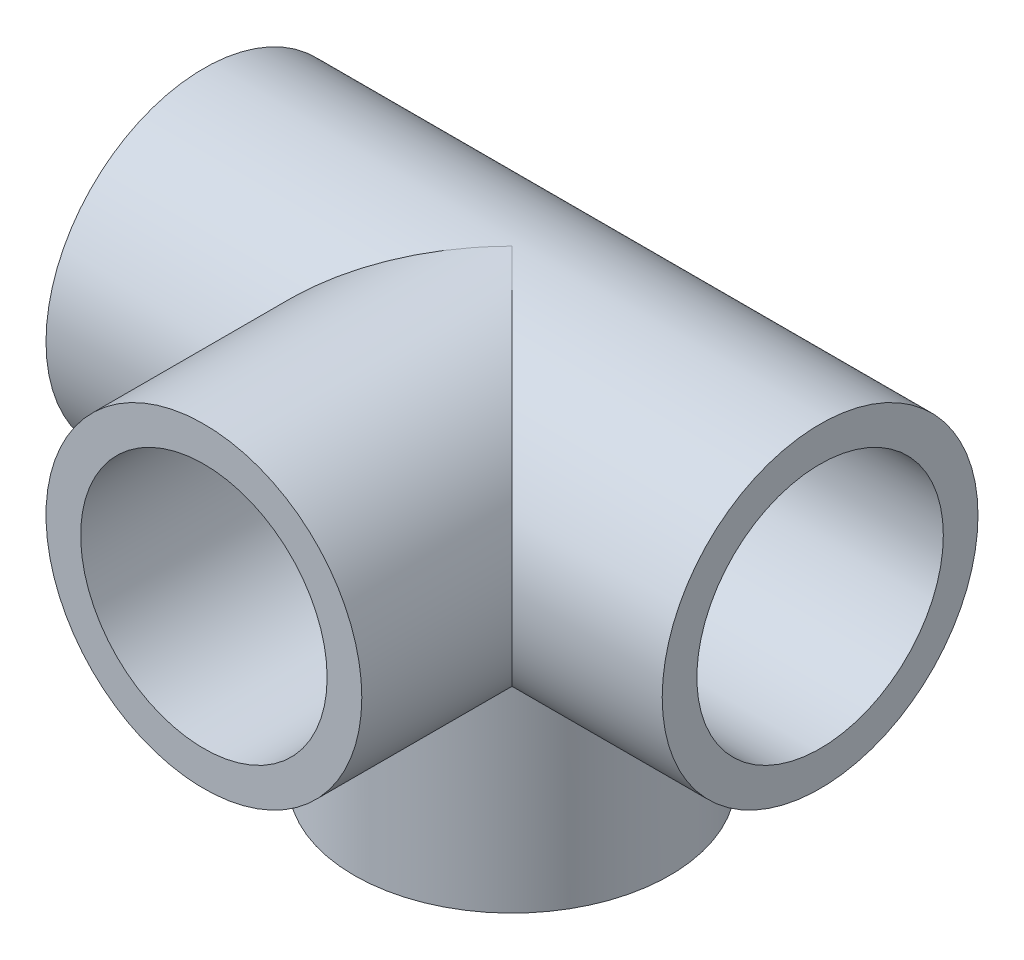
ISO-10303-21;
HEADER;
FILE_DESCRIPTION(('STEP AP214'),'2;1');
FILE_NAME('part.step','',(''),(''),'','','');
FILE_SCHEMA(('AUTOMOTIVE_DESIGN { 1 0 10303 214 1 1 1 1 }'));
ENDSEC;
DATA;
#1=APPLICATION_CONTEXT('core data for automotive mechanical design processes');
#2=APPLICATION_PROTOCOL_DEFINITION('international standard','automotive_design',2000,#1);
#3=PRODUCT_CONTEXT('',#1,'mechanical');
#4=PRODUCT('Part','Part','',(#3));
#5=PRODUCT_RELATED_PRODUCT_CATEGORY('part','',(#4));
#6=PRODUCT_DEFINITION_FORMATION('','',#4);
#7=PRODUCT_DEFINITION_CONTEXT('part definition',#1,'design');
#8=PRODUCT_DEFINITION('design','',#6,#7);
#9=PRODUCT_DEFINITION_SHAPE('','',#8);
#10=(LENGTH_UNIT() NAMED_UNIT(*) SI_UNIT(.MILLI.,.METRE.));
#11=(NAMED_UNIT(*) PLANE_ANGLE_UNIT() SI_UNIT($,.RADIAN.));
#12=(NAMED_UNIT(*) SI_UNIT($,.STERADIAN.) SOLID_ANGLE_UNIT());
#13=UNCERTAINTY_MEASURE_WITH_UNIT(LENGTH_MEASURE(1.E-05),#10,'distance_accuracy_value','');
#14=(GEOMETRIC_REPRESENTATION_CONTEXT(3) GLOBAL_UNCERTAINTY_ASSIGNED_CONTEXT((#13)) GLOBAL_UNIT_ASSIGNED_CONTEXT((#10,
#11,#12)) REPRESENTATION_CONTEXT('',''));
#15=CARTESIAN_POINT('',(0.,0.,0.));
#16=DIRECTION('',(0.,0.,1.));
#17=DIRECTION('',(1.,0.,0.));
#18=AXIS2_PLACEMENT_3D('',#15,#16,#17);
#19=CARTESIAN_POINT('',(40.,0.,0.));
#20=DIRECTION('',(-1.,0.,0.));
#21=DIRECTION('',(0.,0.,1.));
#22=AXIS2_PLACEMENT_3D('',#19,#20,#21);
#23=CYLINDRICAL_SURFACE('',#22,20.5);
#24=CARTESIAN_POINT('',(-40.,0.,0.));
#25=DIRECTION('',(1.,0.,0.));
#26=DIRECTION('',(0.,0.,-1.));
#27=AXIS2_PLACEMENT_3D('',#24,#25,#26);
#28=CIRCLE('',#27,20.5);
#29=CARTESIAN_POINT('',(-40.,0.,-20.5));
#30=VERTEX_POINT('',#29);
#31=EDGE_CURVE('E110',#30,#30,#28,.T.);
#32=ORIENTED_EDGE('',*,*,#31,.T.);
#33=EDGE_LOOP('',(#32));
#34=FACE_BOUND('',#33,.T.);
#35=CARTESIAN_POINT('',(40.,0.,0.));
#36=DIRECTION('',(1.,0.,0.));
#37=DIRECTION('',(0.,0.,-1.));
#38=AXIS2_PLACEMENT_3D('',#35,#36,#37);
#39=CIRCLE('',#38,20.5);
#40=CARTESIAN_POINT('',(40.,0.,-20.5));
#41=VERTEX_POINT('',#40);
#42=EDGE_CURVE('E107',#41,#41,#39,.T.);
#43=ORIENTED_EDGE('',*,*,#42,.F.);
#44=EDGE_LOOP('',(#43));
#45=FACE_BOUND('',#44,.T.);
#46=CARTESIAN_POINT('',(0.,0.,0.));
#47=DIRECTION('',(-0.707106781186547,0.,-0.707106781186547));
#48=DIRECTION('',(-0.707106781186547,0.,0.707106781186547));
#49=AXIS2_PLACEMENT_3D('',#46,#47,#48);
#50=ELLIPSE('',#49,28.9913780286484,20.5);
#51=CARTESIAN_POINT('',(0.,20.5,0.));
#52=VERTEX_POINT('',#51);
#53=CARTESIAN_POINT('',(-14.4956890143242,-14.4956890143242,14.4956890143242));
#54=VERTEX_POINT('',#53);
#55=EDGE_CURVE('E51',#52,#54,#50,.F.);
#56=ORIENTED_EDGE('',*,*,#55,.F.);
#57=CARTESIAN_POINT('',(0.,0.,0.));
#58=DIRECTION('',(-0.707106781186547,0.,0.707106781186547));
#59=DIRECTION('',(-0.707106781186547,0.,-0.707106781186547));
#60=AXIS2_PLACEMENT_3D('',#57,#58,#59);
#61=ELLIPSE('',#60,28.9913780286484,20.5);
#62=CARTESIAN_POINT('',(14.4956890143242,-14.4956890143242,14.4956890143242));
#63=VERTEX_POINT('',#62);
#64=EDGE_CURVE('E59',#63,#52,#61,.T.);
#65=ORIENTED_EDGE('',*,*,#64,.F.);
#66=CARTESIAN_POINT('',(0.,0.,0.));
#67=DIRECTION('',(-0.707106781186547,-0.707106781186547,0.));
#68=DIRECTION('',(-0.707106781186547,0.707106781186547,0.));
#69=AXIS2_PLACEMENT_3D('',#66,#67,#68);
#70=ELLIPSE('',#69,28.9913780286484,20.5);
#71=CARTESIAN_POINT('',(0.,0.,-20.5));
#72=VERTEX_POINT('',#71);
#73=EDGE_CURVE('E105',#63,#72,#70,.F.);
#74=ORIENTED_EDGE('',*,*,#73,.T.);
#75=CARTESIAN_POINT('',(0.,0.,0.));
#76=DIRECTION('',(-0.707106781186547,0.707106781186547,0.));
#77=DIRECTION('',(-0.707106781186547,-0.707106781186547,0.));
#78=AXIS2_PLACEMENT_3D('',#75,#76,#77);
#79=ELLIPSE('',#78,28.9913780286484,20.5);
#80=EDGE_CURVE('E42',#72,#54,#79,.T.);
#81=ORIENTED_EDGE('',*,*,#80,.T.);
#82=EDGE_LOOP('',(#56,#65,#74,#81));
#83=FACE_BOUND('',#82,.T.);
#84=ADVANCED_FACE('F32',(#34,#45,#83),#23,.T.);
#85=CARTESIAN_POINT('',(0.,-40.,0.));
#86=DIRECTION('',(0.,1.,0.));
#87=DIRECTION('',(0.,0.,1.));
#88=AXIS2_PLACEMENT_3D('',#85,#86,#87);
#89=CYLINDRICAL_SURFACE('',#88,20.5);
#90=CARTESIAN_POINT('',(0.,-40.,0.));
#91=DIRECTION('',(0.,1.,0.));
#92=DIRECTION('',(0.,0.,1.));
#93=AXIS2_PLACEMENT_3D('',#90,#91,#92);
#94=CIRCLE('',#93,20.5);
#95=CARTESIAN_POINT('',(0.,-40.,20.5));
#96=VERTEX_POINT('',#95);
#97=EDGE_CURVE('E103',#96,#96,#94,.T.);
#98=ORIENTED_EDGE('',*,*,#97,.T.);
#99=EDGE_LOOP('',(#98));
#100=FACE_BOUND('',#99,.T.);
#101=ORIENTED_EDGE('',*,*,#73,.F.);
#102=CARTESIAN_POINT('',(0.,0.,0.));
#103=DIRECTION('',(0.,0.707106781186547,0.707106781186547));
#104=DIRECTION('',(0.,0.707106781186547,-0.707106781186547));
#105=AXIS2_PLACEMENT_3D('',#102,#103,#104);
#106=ELLIPSE('',#105,28.9913780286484,20.5);
#107=EDGE_CURVE('E11',#63,#54,#106,.F.);
#108=ORIENTED_EDGE('',*,*,#107,.T.);
#109=ORIENTED_EDGE('',*,*,#80,.F.);
#110=EDGE_LOOP('',(#101,#108,#109));
#111=FACE_BOUND('',#110,.T.);
#112=ADVANCED_FACE('F117',(#100,#111),#89,.T.);
#113=CARTESIAN_POINT('',(40.,0.,0.));
#114=DIRECTION('',(1.,0.,0.));
#115=DIRECTION('',(0.,0.,-1.));
#116=AXIS2_PLACEMENT_3D('',#113,#114,#115);
#117=PLANE('',#116);
#118=CARTESIAN_POINT('',(40.,0.,0.));
#119=DIRECTION('',(1.,0.,0.));
#120=DIRECTION('',(0.,0.,-1.));
#121=AXIS2_PLACEMENT_3D('',#118,#119,#120);
#122=CIRCLE('',#121,16.);
#123=CARTESIAN_POINT('',(40.,0.,-16.));
#124=VERTEX_POINT('',#123);
#125=EDGE_CURVE('E93',#124,#124,#122,.T.);
#126=ORIENTED_EDGE('',*,*,#125,.F.);
#127=EDGE_LOOP('',(#126));
#128=FACE_BOUND('',#127,.T.);
#129=ORIENTED_EDGE('',*,*,#42,.T.);
#130=EDGE_LOOP('',(#129));
#131=FACE_BOUND('',#130,.T.);
#132=ADVANCED_FACE('F131',(#128,#131),#117,.T.);
#133=CARTESIAN_POINT('',(-40.,0.,0.));
#134=DIRECTION('',(1.,0.,0.));
#135=DIRECTION('',(0.,0.,-1.));
#136=AXIS2_PLACEMENT_3D('',#133,#134,#135);
#137=PLANE('',#136);
#138=CARTESIAN_POINT('',(-40.,0.,0.));
#139=DIRECTION('',(1.,0.,0.));
#140=DIRECTION('',(0.,0.,-1.));
#141=AXIS2_PLACEMENT_3D('',#138,#139,#140);
#142=CIRCLE('',#141,16.);
#143=CARTESIAN_POINT('',(-40.,0.,-16.));
#144=VERTEX_POINT('',#143);
#145=EDGE_CURVE('E89',#144,#144,#142,.T.);
#146=ORIENTED_EDGE('',*,*,#145,.T.);
#147=EDGE_LOOP('',(#146));
#148=FACE_BOUND('',#147,.T.);
#149=ORIENTED_EDGE('',*,*,#31,.F.);
#150=EDGE_LOOP('',(#149));
#151=FACE_BOUND('',#150,.T.);
#152=ADVANCED_FACE('F122',(#148,#151),#137,.F.);
#153=CARTESIAN_POINT('',(0.,-40.,0.));
#154=DIRECTION('',(0.,1.,0.));
#155=DIRECTION('',(0.,0.,1.));
#156=AXIS2_PLACEMENT_3D('',#153,#154,#155);
#157=PLANE('',#156);
#158=CARTESIAN_POINT('',(0.,-40.,0.));
#159=DIRECTION('',(0.,1.,0.));
#160=DIRECTION('',(0.,0.,1.));
#161=AXIS2_PLACEMENT_3D('',#158,#159,#160);
#162=CIRCLE('',#161,16.);
#163=CARTESIAN_POINT('',(0.,-40.,16.));
#164=VERTEX_POINT('',#163);
#165=EDGE_CURVE('E86',#164,#164,#162,.T.);
#166=ORIENTED_EDGE('',*,*,#165,.T.);
#167=EDGE_LOOP('',(#166));
#168=FACE_BOUND('',#167,.T.);
#169=ORIENTED_EDGE('',*,*,#97,.F.);
#170=EDGE_LOOP('',(#169));
#171=FACE_BOUND('',#170,.T.);
#172=ADVANCED_FACE('F120',(#168,#171),#157,.F.);
#173=CARTESIAN_POINT('',(0.,0.,40.));
#174=DIRECTION('',(0.,0.,-1.));
#175=DIRECTION('',(-1.,0.,0.));
#176=AXIS2_PLACEMENT_3D('',#173,#174,#175);
#177=CYLINDRICAL_SURFACE('',#176,20.5);
#178=CARTESIAN_POINT('',(0.,0.,40.));
#179=DIRECTION('',(0.,0.,1.));
#180=DIRECTION('',(1.,0.,0.));
#181=AXIS2_PLACEMENT_3D('',#178,#179,#180);
#182=CIRCLE('',#181,20.5);
#183=CARTESIAN_POINT('',(20.5,0.,40.));
#184=VERTEX_POINT('',#183);
#185=EDGE_CURVE('E36',#184,#184,#182,.T.);
#186=ORIENTED_EDGE('',*,*,#185,.F.);
#187=EDGE_LOOP('',(#186));
#188=FACE_BOUND('',#187,.T.);
#189=ORIENTED_EDGE('',*,*,#64,.T.);
#190=ORIENTED_EDGE('',*,*,#55,.T.);
#191=ORIENTED_EDGE('',*,*,#107,.F.);
#192=EDGE_LOOP('',(#189,#190,#191));
#193=FACE_BOUND('',#192,.T.);
#194=ADVANCED_FACE('F34',(#188,#193),#177,.T.);
#195=CARTESIAN_POINT('',(0.,0.,40.));
#196=DIRECTION('',(0.,0.,1.));
#197=DIRECTION('',(1.,0.,0.));
#198=AXIS2_PLACEMENT_3D('',#195,#196,#197);
#199=PLANE('',#198);
#200=CARTESIAN_POINT('',(0.,0.,40.));
#201=DIRECTION('',(0.,0.,1.));
#202=DIRECTION('',(1.,0.,0.));
#203=AXIS2_PLACEMENT_3D('',#200,#201,#202);
#204=CIRCLE('',#203,16.);
#205=CARTESIAN_POINT('',(16.,0.,40.));
#206=VERTEX_POINT('',#205);
#207=EDGE_CURVE('E82',#206,#206,#204,.T.);
#208=ORIENTED_EDGE('',*,*,#207,.F.);
#209=EDGE_LOOP('',(#208));
#210=FACE_BOUND('',#209,.T.);
#211=ORIENTED_EDGE('',*,*,#185,.T.);
#212=EDGE_LOOP('',(#211));
#213=FACE_BOUND('',#212,.T.);
#214=ADVANCED_FACE('F129',(#210,#213),#199,.T.);
#215=CARTESIAN_POINT('',(40.,0.,0.));
#216=DIRECTION('',(-1.,0.,0.));
#217=DIRECTION('',(0.,0.,1.));
#218=AXIS2_PLACEMENT_3D('',#215,#216,#217);
#219=CYLINDRICAL_SURFACE('',#218,16.);
#220=ORIENTED_EDGE('',*,*,#145,.F.);
#221=EDGE_LOOP('',(#220));
#222=FACE_BOUND('',#221,.T.);
#223=ORIENTED_EDGE('',*,*,#125,.T.);
#224=EDGE_LOOP('',(#223));
#225=FACE_BOUND('',#224,.T.);
#226=CARTESIAN_POINT('',(0.,0.,0.));
#227=DIRECTION('',(-0.707106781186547,0.,-0.707106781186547));
#228=DIRECTION('',(-0.707106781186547,0.,0.707106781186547));
#229=AXIS2_PLACEMENT_3D('',#226,#227,#228);
#230=ELLIPSE('',#229,22.6274169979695,16.);
#231=CARTESIAN_POINT('',(0.,16.,0.));
#232=VERTEX_POINT('',#231);
#233=CARTESIAN_POINT('',(-11.3137084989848,-11.3137084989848,11.3137084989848));
#234=VERTEX_POINT('',#233);
#235=EDGE_CURVE('E66',#232,#234,#230,.F.);
#236=ORIENTED_EDGE('',*,*,#235,.T.);
#237=CARTESIAN_POINT('',(0.,0.,0.));
#238=DIRECTION('',(-0.707106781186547,0.707106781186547,0.));
#239=DIRECTION('',(-0.707106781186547,-0.707106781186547,0.));
#240=AXIS2_PLACEMENT_3D('',#237,#238,#239);
#241=ELLIPSE('',#240,22.6274169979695,16.);
#242=CARTESIAN_POINT('',(0.,0.,-16.));
#243=VERTEX_POINT('',#242);
#244=EDGE_CURVE('E99',#243,#234,#241,.T.);
#245=ORIENTED_EDGE('',*,*,#244,.F.);
#246=CARTESIAN_POINT('',(0.,0.,0.));
#247=DIRECTION('',(-0.707106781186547,-0.707106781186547,0.));
#248=DIRECTION('',(-0.707106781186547,0.707106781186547,0.));
#249=AXIS2_PLACEMENT_3D('',#246,#247,#248);
#250=ELLIPSE('',#249,22.6274169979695,16.);
#251=CARTESIAN_POINT('',(11.3137084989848,-11.3137084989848,11.3137084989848));
#252=VERTEX_POINT('',#251);
#253=EDGE_CURVE('E74',#252,#243,#250,.F.);
#254=ORIENTED_EDGE('',*,*,#253,.F.);
#255=CARTESIAN_POINT('',(0.,0.,0.));
#256=DIRECTION('',(-0.707106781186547,0.,0.707106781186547));
#257=DIRECTION('',(-0.707106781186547,0.,-0.707106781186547));
#258=AXIS2_PLACEMENT_3D('',#255,#256,#257);
#259=ELLIPSE('',#258,22.6274169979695,16.);
#260=EDGE_CURVE('E79',#252,#232,#259,.T.);
#261=ORIENTED_EDGE('',*,*,#260,.T.);
#262=EDGE_LOOP('',(#236,#245,#254,#261));
#263=FACE_BOUND('',#262,.T.);
#264=ADVANCED_FACE('F80',(#222,#225,#263),#219,.F.);
#265=CARTESIAN_POINT('',(0.,-40.,0.));
#266=DIRECTION('',(0.,1.,0.));
#267=DIRECTION('',(0.,0.,1.));
#268=AXIS2_PLACEMENT_3D('',#265,#266,#267);
#269=CYLINDRICAL_SURFACE('',#268,16.);
#270=ORIENTED_EDGE('',*,*,#165,.F.);
#271=EDGE_LOOP('',(#270));
#272=FACE_BOUND('',#271,.T.);
#273=ORIENTED_EDGE('',*,*,#253,.T.);
#274=ORIENTED_EDGE('',*,*,#244,.T.);
#275=CARTESIAN_POINT('',(0.,0.,0.));
#276=DIRECTION('',(0.,0.707106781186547,0.707106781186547));
#277=DIRECTION('',(0.,0.707106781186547,-0.707106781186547));
#278=AXIS2_PLACEMENT_3D('',#275,#276,#277);
#279=ELLIPSE('',#278,22.6274169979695,16.);
#280=EDGE_CURVE('E85',#252,#234,#279,.F.);
#281=ORIENTED_EDGE('',*,*,#280,.F.);
#282=EDGE_LOOP('',(#273,#274,#281));
#283=FACE_BOUND('',#282,.T.);
#284=ADVANCED_FACE('F155',(#272,#283),#269,.F.);
#285=CARTESIAN_POINT('',(0.,0.,40.));
#286=DIRECTION('',(0.,0.,-1.));
#287=DIRECTION('',(-1.,0.,0.));
#288=AXIS2_PLACEMENT_3D('',#285,#286,#287);
#289=CYLINDRICAL_SURFACE('',#288,16.);
#290=ORIENTED_EDGE('',*,*,#207,.T.);
#291=EDGE_LOOP('',(#290));
#292=FACE_BOUND('',#291,.T.);
#293=ORIENTED_EDGE('',*,*,#260,.F.);
#294=ORIENTED_EDGE('',*,*,#280,.T.);
#295=ORIENTED_EDGE('',*,*,#235,.F.);
#296=EDGE_LOOP('',(#293,#294,#295));
#297=FACE_BOUND('',#296,.T.);
#298=ADVANCED_FACE('F84',(#292,#297),#289,.F.);
#299=CLOSED_SHELL('',(#84,#112,#132,#152,#172,#194,#214,#264,#284,#298));
#300=MANIFOLD_SOLID_BREP('B2',#299);
#301=ADVANCED_BREP_SHAPE_REPRESENTATION('',(#18,#300),#14);
#302=SHAPE_DEFINITION_REPRESENTATION(#9,#301);
ENDSEC;
END-ISO-10303-21;
